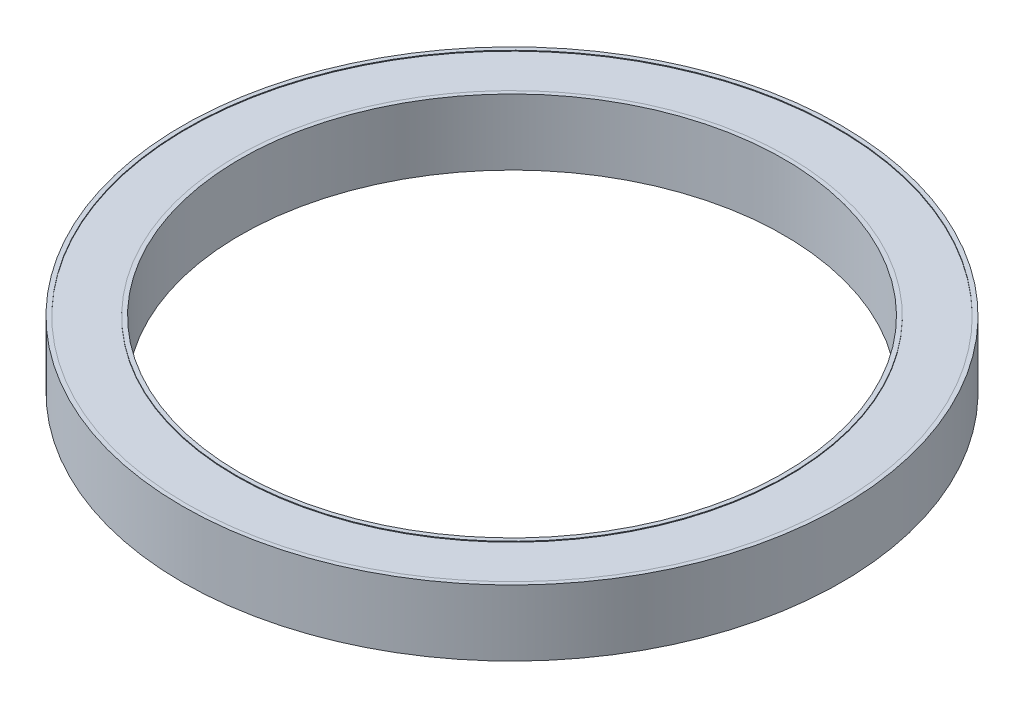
from build123d import *

# Parameters (mm, degrees)
CROQUIS1_R              = 400
CROQUIS1_R_2            = 330
SALIENTE_EXTRUIR1_DEPTH = 80
CROQUIS2_R              = 395
CROQUIS2_R_2            = 335
CORTAR_EXTRUIR1_DEPTH   = 1
CORTAR_EXTRUIR2_START   = -25
CROQUIS3_R              = 395
CROQUIS3_R_2            = 335
CORTAR_EXTRUIR2_DEPTH   = 25


with BuildPart() as part:
    # Croquis1 → Saliente-Extruir1 (new body)
    with BuildSketch(Plane(origin=(0, 0, 0), x_dir=(1, 0, 0), z_dir=(0, 1, 0))):
        with Locations(Location((0, 0, 0), (0, 0, 270))):
            Circle(CROQUIS1_R)
        with Locations(Location((0, 0, 0), (0, 0, 270))):
            Circle(CROQUIS1_R_2, mode=Mode.SUBTRACT)
    extrude(amount=SALIENTE_EXTRUIR1_DEPTH)

    # Croquis2 → Cortar-Extruir1 (cut)
    with BuildSketch(Plane(origin=(0, 80, 0), x_dir=(1, 0, 0), z_dir=(0, 1, 0))):
        with Locations(Location((0, 0, 0), (0, 0, 270))):
            Circle(CROQUIS2_R)
        with Locations(Location((0, 0, 0), (0, 0, 270))):
            Circle(CROQUIS2_R_2, mode=Mode.SUBTRACT)
    extrude(amount=-CORTAR_EXTRUIR1_DEPTH, mode=Mode.SUBTRACT)

    # Croquis3 → Cortar-Extruir2 (cut)
    with BuildSketch(Plane.XZ.offset(CORTAR_EXTRUIR2_START)):
        with Locations(Location((0, 0, 0), (0, 0, 90))):
            Circle(CROQUIS3_R)
        with Locations(Location((0, 0, 0), (0, 0, 90))):
            Circle(CROQUIS3_R_2, mode=Mode.SUBTRACT)
    extrude(amount=CORTAR_EXTRUIR2_DEPTH, mode=Mode.SUBTRACT)


solid = part.part
